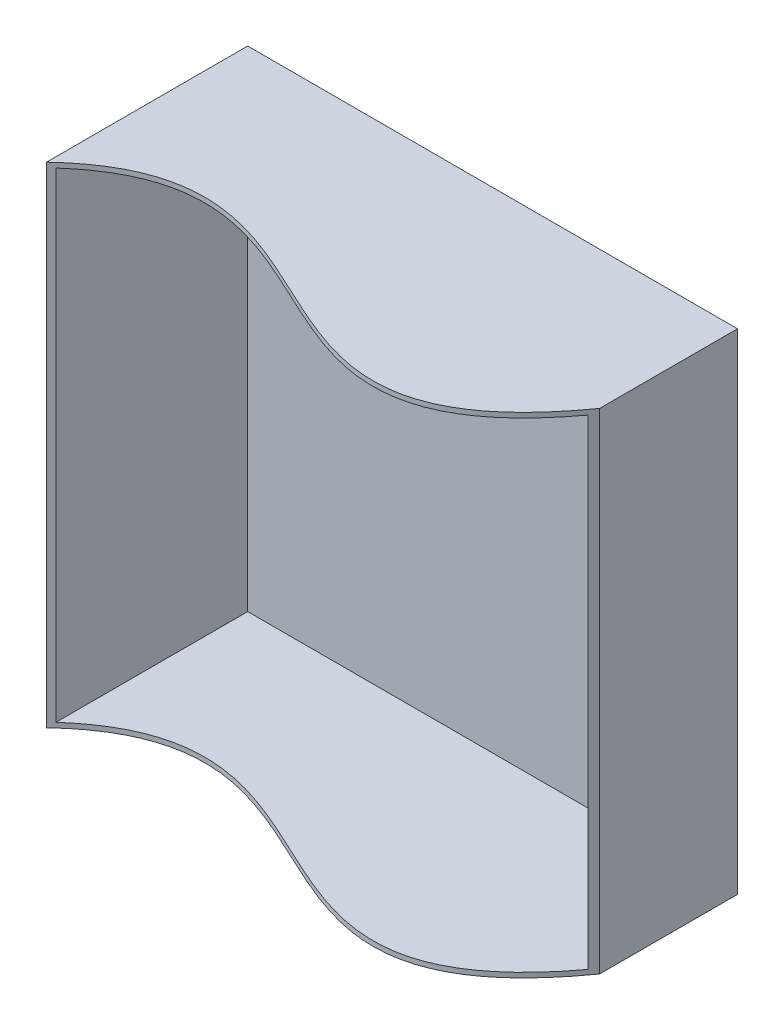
from build123d import *

# Parameters (mm, degrees)
SKIZZE1_W                       = 100
SKIZZE1_H                       = 100
AUFSATZ_LINEAR_AUSTRAGEN1_DEPTH = 100
WANDUNG1_T                      = -1
SCHNITT_LINEAR_AUSTRAGEN1_DEPTH = 151


with BuildPart() as part:
    # Skizze1 → Aufsatz-Linear austragen1 (new body)
    with BuildSketch(Plane.XY):
        Rectangle(SKIZZE1_W, SKIZZE1_H)
    extrude(amount=AUFSATZ_LINEAR_AUSTRAGEN1_DEPTH)

    # Wandung1
    wandung1_openings = [part.faces().sort_by_distance(p)[0] for p in [
        (0, 0, 100),
    ]]
    offset(amount=WANDUNG1_T, openings=wandung1_openings, kind=Kind.INTERSECTION)

    # Skizze2 → Schnitt-Linear austragen1 (cut, through all)
    with BuildSketch(Plane(origin=(0, 50, 0), x_dir=(-1, 0, 0), z_dir=(0, 1, 0))):
        with BuildLine():
            Line((50, 41.077538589), (50, 100))
            Line((50, 100), (-50, 100))
            Line((-50, 100), (-50, 28.155353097))
            add(Edge.make_bspline(
                [(50, 41.077538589), (13.036398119, 6.22595689), (-14.530126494, 77.941452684), (-50, 28.155353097)],
                knots=[0, 0, 0, 0, 1, 1, 1, 1], degree=3))
        make_face()
    extrude(amount=-SCHNITT_LINEAR_AUSTRAGEN1_DEPTH, mode=Mode.SUBTRACT)


solid = part.part
